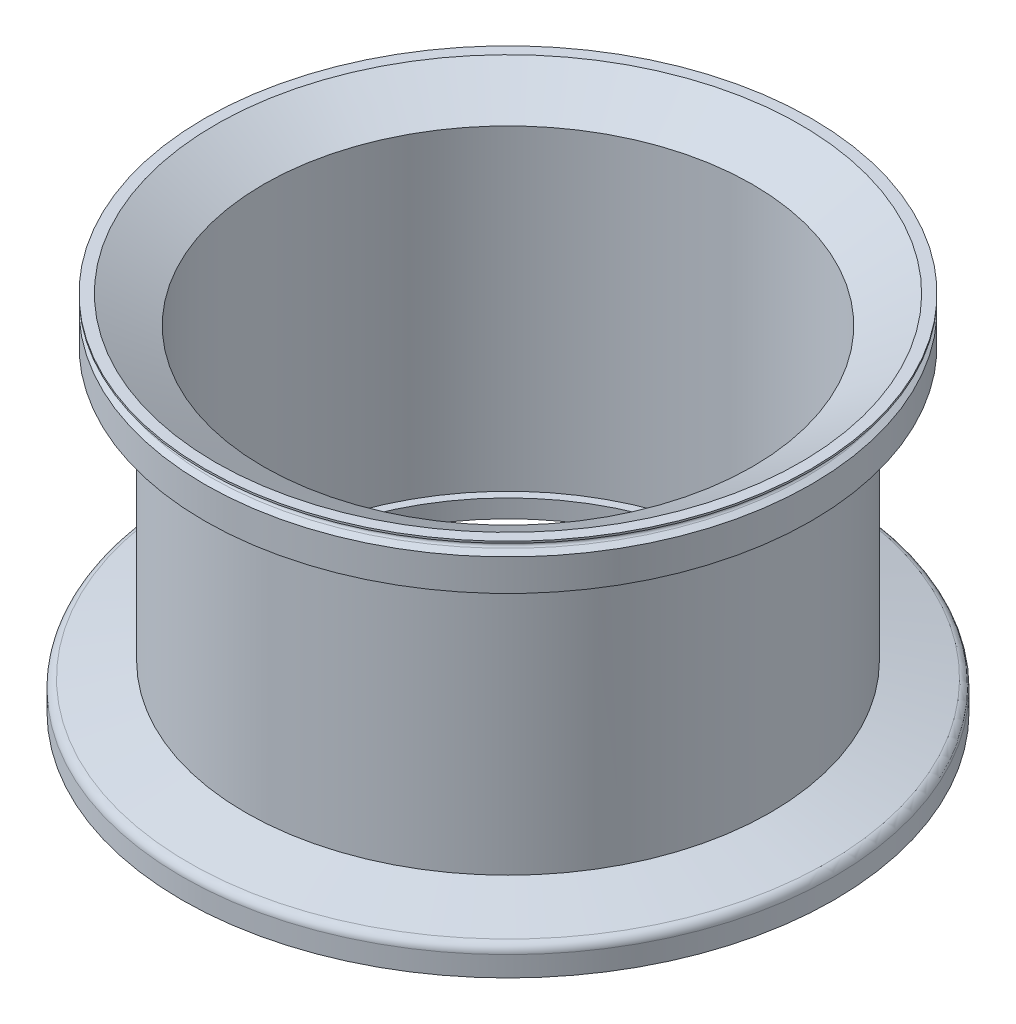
ISO-10303-21;
HEADER;
FILE_DESCRIPTION(('STEP AP214'),'2;1');
FILE_NAME('part.step','',(''),(''),'','','');
FILE_SCHEMA(('AUTOMOTIVE_DESIGN { 1 0 10303 214 1 1 1 1 }'));
ENDSEC;
DATA;
#1=APPLICATION_CONTEXT('core data for automotive mechanical design processes');
#2=APPLICATION_PROTOCOL_DEFINITION('international standard','automotive_design',2000,#1);
#3=PRODUCT_CONTEXT('',#1,'mechanical');
#4=PRODUCT('Part','Part','',(#3));
#5=PRODUCT_RELATED_PRODUCT_CATEGORY('part','',(#4));
#6=PRODUCT_DEFINITION_FORMATION('','',#4);
#7=PRODUCT_DEFINITION_CONTEXT('part definition',#1,'design');
#8=PRODUCT_DEFINITION('design','',#6,#7);
#9=PRODUCT_DEFINITION_SHAPE('','',#8);
#10=(LENGTH_UNIT() NAMED_UNIT(*) SI_UNIT(.MILLI.,.METRE.));
#11=(NAMED_UNIT(*) PLANE_ANGLE_UNIT() SI_UNIT($,.RADIAN.));
#12=(NAMED_UNIT(*) SI_UNIT($,.STERADIAN.) SOLID_ANGLE_UNIT());
#13=UNCERTAINTY_MEASURE_WITH_UNIT(LENGTH_MEASURE(1.E-05),#10,'distance_accuracy_value','');
#14=(GEOMETRIC_REPRESENTATION_CONTEXT(3) GLOBAL_UNCERTAINTY_ASSIGNED_CONTEXT((#13)) GLOBAL_UNIT_ASSIGNED_CONTEXT((#10,
#11,#12)) REPRESENTATION_CONTEXT('',''));
#15=CARTESIAN_POINT('',(0.,0.,0.));
#16=DIRECTION('',(0.,0.,1.));
#17=DIRECTION('',(1.,0.,0.));
#18=AXIS2_PLACEMENT_3D('',#15,#16,#17);
#19=CARTESIAN_POINT('',(0.,0.,0.));
#20=DIRECTION('',(0.,1.,0.));
#21=DIRECTION('',(0.,0.,1.));
#22=AXIS2_PLACEMENT_3D('',#19,#20,#21);
#23=CYLINDRICAL_SURFACE('',#22,33.5);
#24=CARTESIAN_POINT('',(0.,34.9999999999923,0.));
#25=DIRECTION('',(0.,1.,0.));
#26=DIRECTION('',(0.,0.,1.));
#27=AXIS2_PLACEMENT_3D('',#24,#25,#26);
#28=CIRCLE('',#27,33.5);
#29=CARTESIAN_POINT('',(0.,34.9999999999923,33.5));
#30=VERTEX_POINT('',#29);
#31=EDGE_CURVE('E18',#30,#30,#28,.F.);
#32=ORIENTED_EDGE('',*,*,#31,.F.);
#33=EDGE_LOOP('',(#32));
#34=FACE_BOUND('',#33,.T.);
#35=CARTESIAN_POINT('',(0.,38.4999999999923,0.));
#36=DIRECTION('',(0.,-1.,0.));
#37=DIRECTION('',(0.,0.,-1.));
#38=AXIS2_PLACEMENT_3D('',#35,#36,#37);
#39=CIRCLE('',#38,33.5);
#40=CARTESIAN_POINT('',(0.,38.4999999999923,-33.5));
#41=VERTEX_POINT('',#40);
#42=EDGE_CURVE('E31',#41,#41,#39,.F.);
#43=ORIENTED_EDGE('',*,*,#42,.F.);
#44=EDGE_LOOP('',(#43));
#45=FACE_BOUND('',#44,.T.);
#46=ADVANCED_FACE('F15',(#34,#45),#23,.T.);
#47=CARTESIAN_POINT('',(33.5,34.9999999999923,0.));
#48=DIRECTION('',(0.,-1.,0.));
#49=DIRECTION('',(0.,0.,-1.));
#50=AXIS2_PLACEMENT_3D('',#47,#48,#49);
#51=PLANE('',#50);
#52=ORIENTED_EDGE('',*,*,#31,.T.);
#53=EDGE_LOOP('',(#52));
#54=FACE_BOUND('',#53,.T.);
#55=CARTESIAN_POINT('',(0.,34.9999999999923,0.));
#56=DIRECTION('',(0.,1.,0.));
#57=DIRECTION('',(0.,0.,1.));
#58=AXIS2_PLACEMENT_3D('',#55,#56,#57);
#59=CIRCLE('',#58,29.);
#60=CARTESIAN_POINT('',(0.,34.9999999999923,29.));
#61=VERTEX_POINT('',#60);
#62=EDGE_CURVE('E47',#61,#61,#59,.F.);
#63=ORIENTED_EDGE('',*,*,#62,.F.);
#64=EDGE_LOOP('',(#63));
#65=FACE_BOUND('',#64,.T.);
#66=ADVANCED_FACE('F60',(#54,#65),#51,.T.);
#67=CARTESIAN_POINT('',(0.,38.4999999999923,0.));
#68=DIRECTION('',(0.,-1.,0.));
#69=DIRECTION('',(0.,0.,-1.));
#70=AXIS2_PLACEMENT_3D('',#67,#68,#69);
#71=CONICAL_SURFACE('',#70,33.5,1.04719755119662);
#72=CARTESIAN_POINT('',(0.,38.8678203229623,0.));
#73=DIRECTION('',(0.,1.,0.));
#74=DIRECTION('',(0.,0.,1.));
#75=AXIS2_PLACEMENT_3D('',#72,#73,#74);
#76=CIRCLE('',#75,32.8629165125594);
#77=CARTESIAN_POINT('',(0.,38.8678203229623,32.8629165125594));
#78=VERTEX_POINT('',#77);
#79=EDGE_CURVE('E49',#78,#78,#76,.F.);
#80=ORIENTED_EDGE('',*,*,#79,.T.);
#81=EDGE_LOOP('',(#80));
#82=FACE_BOUND('',#81,.T.);
#83=ORIENTED_EDGE('',*,*,#42,.T.);
#84=EDGE_LOOP('',(#83));
#85=FACE_BOUND('',#84,.T.);
#86=ADVANCED_FACE('F69',(#82,#85),#71,.T.);
#87=CARTESIAN_POINT('',(0.,0.,0.));
#88=DIRECTION('',(0.,1.,0.));
#89=DIRECTION('',(0.,0.,1.));
#90=AXIS2_PLACEMENT_3D('',#87,#88,#89);
#91=CYLINDRICAL_SURFACE('',#90,29.);
#92=CARTESIAN_POINT('',(0.,4.87564434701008,0.));
#93=DIRECTION('',(0.,-1.,0.));
#94=DIRECTION('',(0.,0.,-1.));
#95=AXIS2_PLACEMENT_3D('',#92,#93,#94);
#96=CIRCLE('',#95,29.);
#97=CARTESIAN_POINT('',(0.,4.87564434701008,-29.));
#98=VERTEX_POINT('',#97);
#99=EDGE_CURVE('E53',#98,#98,#96,.T.);
#100=ORIENTED_EDGE('',*,*,#99,.F.);
#101=EDGE_LOOP('',(#100));
#102=FACE_BOUND('',#101,.T.);
#103=ORIENTED_EDGE('',*,*,#62,.T.);
#104=EDGE_LOOP('',(#103));
#105=FACE_BOUND('',#104,.T.);
#106=ADVANCED_FACE('F137',(#102,#105),#91,.T.);
#107=CARTESIAN_POINT('',(0.,3.19859883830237,0.));
#108=DIRECTION('',(0.,-1.,0.));
#109=DIRECTION('',(0.,0.,-1.));
#110=AXIS2_PLACEMENT_3D('',#107,#108,#109);
#111=CONICAL_SURFACE('',#110,35.2588190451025,1.30899693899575);
#112=ORIENTED_EDGE('',*,*,#99,.T.);
#113=EDGE_LOOP('',(#112));
#114=FACE_BOUND('',#113,.T.);
#115=CARTESIAN_POINT('',(0.,3.19859883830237,0.));
#116=DIRECTION('',(0.,-1.,0.));
#117=DIRECTION('',(0.,0.,-1.));
#118=AXIS2_PLACEMENT_3D('',#115,#116,#117);
#119=CIRCLE('',#118,35.2588190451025);
#120=CARTESIAN_POINT('',(0.,3.19859883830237,-35.2588190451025));
#121=VERTEX_POINT('',#120);
#122=EDGE_CURVE('E126',#121,#121,#119,.T.);
#123=ORIENTED_EDGE('',*,*,#122,.F.);
#124=EDGE_LOOP('',(#123));
#125=FACE_BOUND('',#124,.T.);
#126=ADVANCED_FACE('F134',(#114,#125),#111,.T.);
#127=CARTESIAN_POINT('',(0.,39.1499999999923,0.));
#128=DIRECTION('',(0.,1.,0.));
#129=DIRECTION('',(0.,0.,1.));
#130=AXIS2_PLACEMENT_3D('',#127,#128,#129);
#131=TOROIDAL_SURFACE('',#130,33.0258330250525,0.325833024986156);
#132=ORIENTED_EDGE('',*,*,#79,.F.);
#133=EDGE_LOOP('',(#132));
#134=FACE_BOUND('',#133,.T.);
#135=CARTESIAN_POINT('',(0.,39.4321796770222,0.));
#136=DIRECTION('',(0.,1.,0.));
#137=DIRECTION('',(0.,0.,1.));
#138=AXIS2_PLACEMENT_3D('',#135,#136,#137);
#139=CIRCLE('',#138,32.8629165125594);
#140=CARTESIAN_POINT('',(0.,39.4321796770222,32.8629165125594));
#141=VERTEX_POINT('',#140);
#142=EDGE_CURVE('E124',#141,#141,#139,.T.);
#143=ORIENTED_EDGE('',*,*,#142,.F.);
#144=EDGE_LOOP('',(#143));
#145=FACE_BOUND('',#144,.T.);
#146=ADVANCED_FACE('F114',(#134,#145),#131,.F.);
#147=CARTESIAN_POINT('',(0.,2.2326730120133,0.));
#148=DIRECTION('',(0.,-1.,0.));
#149=DIRECTION('',(0.,0.,-1.));
#150=AXIS2_PLACEMENT_3D('',#147,#148,#149);
#151=TOROIDAL_SURFACE('',#150,35.,1.);
#152=ORIENTED_EDGE('',*,*,#122,.T.);
#153=EDGE_LOOP('',(#152));
#154=FACE_BOUND('',#153,.T.);
#155=CARTESIAN_POINT('',(0.,2.2326730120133,0.));
#156=DIRECTION('',(0.,1.,0.));
#157=DIRECTION('',(0.,0.,1.));
#158=AXIS2_PLACEMENT_3D('',#155,#156,#157);
#159=CIRCLE('',#158,36.);
#160=CARTESIAN_POINT('',(0.,2.2326730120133,36.));
#161=VERTEX_POINT('',#160);
#162=EDGE_CURVE('E121',#161,#161,#159,.F.);
#163=ORIENTED_EDGE('',*,*,#162,.F.);
#164=EDGE_LOOP('',(#163));
#165=FACE_BOUND('',#164,.T.);
#166=ADVANCED_FACE('F109',(#154,#165),#151,.T.);
#167=CARTESIAN_POINT('',(0.,39.7999999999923,0.));
#168=DIRECTION('',(0.,1.,0.));
#169=DIRECTION('',(0.,0.,1.));
#170=AXIS2_PLACEMENT_3D('',#167,#168,#169);
#171=CONICAL_SURFACE('',#170,33.5,1.04719755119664);
#172=ORIENTED_EDGE('',*,*,#142,.T.);
#173=EDGE_LOOP('',(#172));
#174=FACE_BOUND('',#173,.T.);
#175=CARTESIAN_POINT('',(0.,39.7999999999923,0.));
#176=DIRECTION('',(0.,1.,0.));
#177=DIRECTION('',(0.,0.,1.));
#178=AXIS2_PLACEMENT_3D('',#175,#176,#177);
#179=CIRCLE('',#178,33.5);
#180=CARTESIAN_POINT('',(0.,39.7999999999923,33.5));
#181=VERTEX_POINT('',#180);
#182=EDGE_CURVE('E46',#181,#181,#179,.T.);
#183=ORIENTED_EDGE('',*,*,#182,.F.);
#184=EDGE_LOOP('',(#183));
#185=FACE_BOUND('',#184,.T.);
#186=ADVANCED_FACE('F105',(#174,#185),#171,.T.);
#187=CARTESIAN_POINT('',(0.,0.,0.));
#188=DIRECTION('',(0.,1.,0.));
#189=DIRECTION('',(0.,0.,1.));
#190=AXIS2_PLACEMENT_3D('',#187,#188,#189);
#191=CYLINDRICAL_SURFACE('',#190,36.);
#192=CARTESIAN_POINT('',(0.,-7.73306743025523E-12,0.));
#193=DIRECTION('',(0.,1.,0.));
#194=DIRECTION('',(0.,0.,1.));
#195=AXIS2_PLACEMENT_3D('',#192,#193,#194);
#196=CIRCLE('',#195,36.);
#197=CARTESIAN_POINT('',(0.,-7.73306743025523E-12,36.));
#198=VERTEX_POINT('',#197);
#199=EDGE_CURVE('E44',#198,#198,#196,.F.);
#200=ORIENTED_EDGE('',*,*,#199,.F.);
#201=EDGE_LOOP('',(#200));
#202=FACE_BOUND('',#201,.T.);
#203=ORIENTED_EDGE('',*,*,#162,.T.);
#204=EDGE_LOOP('',(#203));
#205=FACE_BOUND('',#204,.T.);
#206=ADVANCED_FACE('F101',(#202,#205),#191,.T.);
#207=CARTESIAN_POINT('',(0.,0.,0.));
#208=DIRECTION('',(0.,1.,0.));
#209=DIRECTION('',(0.,0.,1.));
#210=AXIS2_PLACEMENT_3D('',#207,#208,#209);
#211=CYLINDRICAL_SURFACE('',#210,33.5);
#212=ORIENTED_EDGE('',*,*,#182,.T.);
#213=EDGE_LOOP('',(#212));
#214=FACE_BOUND('',#213,.T.);
#215=CARTESIAN_POINT('',(0.,39.9999999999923,0.));
#216=DIRECTION('',(0.,1.,0.));
#217=DIRECTION('',(0.,0.,1.));
#218=AXIS2_PLACEMENT_3D('',#215,#216,#217);
#219=CIRCLE('',#218,33.5);
#220=CARTESIAN_POINT('',(0.,39.9999999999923,33.5));
#221=VERTEX_POINT('',#220);
#222=EDGE_CURVE('E41',#221,#221,#219,.T.);
#223=ORIENTED_EDGE('',*,*,#222,.F.);
#224=EDGE_LOOP('',(#223));
#225=FACE_BOUND('',#224,.T.);
#226=ADVANCED_FACE('F97',(#214,#225),#211,.T.);
#227=CARTESIAN_POINT('',(36.,-7.73306743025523E-12,0.));
#228=DIRECTION('',(0.,-1.,0.));
#229=DIRECTION('',(0.,0.,-1.));
#230=AXIS2_PLACEMENT_3D('',#227,#228,#229);
#231=PLANE('',#230);
#232=ORIENTED_EDGE('',*,*,#199,.T.);
#233=EDGE_LOOP('',(#232));
#234=FACE_BOUND('',#233,.T.);
#235=CARTESIAN_POINT('',(0.,-7.73306743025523E-12,0.));
#236=DIRECTION('',(0.,1.,0.));
#237=DIRECTION('',(0.,0.,1.));
#238=AXIS2_PLACEMENT_3D('',#235,#236,#237);
#239=CIRCLE('',#238,26.1);
#240=CARTESIAN_POINT('',(0.,-7.73306743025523E-12,26.1));
#241=VERTEX_POINT('',#240);
#242=EDGE_CURVE('E38',#241,#241,#239,.T.);
#243=ORIENTED_EDGE('',*,*,#242,.T.);
#244=EDGE_LOOP('',(#243));
#245=FACE_BOUND('',#244,.T.);
#246=ADVANCED_FACE('F93',(#234,#245),#231,.T.);
#247=CARTESIAN_POINT('',(32.2999999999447,39.9999999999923,0.));
#248=DIRECTION('',(0.,1.,0.));
#249=DIRECTION('',(0.,0.,1.));
#250=AXIS2_PLACEMENT_3D('',#247,#248,#249);
#251=PLANE('',#250);
#252=CARTESIAN_POINT('',(0.,39.9999999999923,0.));
#253=DIRECTION('',(0.,1.,0.));
#254=DIRECTION('',(0.,0.,1.));
#255=AXIS2_PLACEMENT_3D('',#252,#253,#254);
#256=CIRCLE('',#255,32.2999999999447);
#257=CARTESIAN_POINT('',(0.,39.9999999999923,32.2999999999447));
#258=VERTEX_POINT('',#257);
#259=EDGE_CURVE('E35',#258,#258,#256,.F.);
#260=ORIENTED_EDGE('',*,*,#259,.T.);
#261=EDGE_LOOP('',(#260));
#262=FACE_BOUND('',#261,.T.);
#263=ORIENTED_EDGE('',*,*,#222,.T.);
#264=EDGE_LOOP('',(#263));
#265=FACE_BOUND('',#264,.T.);
#266=ADVANCED_FACE('F89',(#262,#265),#251,.T.);
#267=CARTESIAN_POINT('',(0.,0.,0.));
#268=DIRECTION('',(0.,1.,0.));
#269=DIRECTION('',(0.,0.,1.));
#270=AXIS2_PLACEMENT_3D('',#267,#268,#269);
#271=CYLINDRICAL_SURFACE('',#270,26.1);
#272=CARTESIAN_POINT('',(0.,1.99999999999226,0.));
#273=DIRECTION('',(0.,1.,0.));
#274=DIRECTION('',(0.,0.,1.));
#275=AXIS2_PLACEMENT_3D('',#272,#273,#274);
#276=CIRCLE('',#275,26.1);
#277=CARTESIAN_POINT('',(0.,1.99999999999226,26.1));
#278=VERTEX_POINT('',#277);
#279=EDGE_CURVE('E27',#278,#278,#276,.F.);
#280=ORIENTED_EDGE('',*,*,#279,.F.);
#281=EDGE_LOOP('',(#280));
#282=FACE_BOUND('',#281,.T.);
#283=ORIENTED_EDGE('',*,*,#242,.F.);
#284=EDGE_LOOP('',(#283));
#285=FACE_BOUND('',#284,.T.);
#286=ADVANCED_FACE('F85',(#282,#285),#271,.F.);
#287=CARTESIAN_POINT('',(0.,39.9999999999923,0.));
#288=DIRECTION('',(0.,1.,0.));
#289=DIRECTION('',(0.,0.,1.));
#290=AXIS2_PLACEMENT_3D('',#287,#288,#289);
#291=CONICAL_SURFACE('',#290,32.2999999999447,1.0471975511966);
#292=ORIENTED_EDGE('',*,*,#259,.F.);
#293=EDGE_LOOP('',(#292));
#294=FACE_BOUND('',#293,.T.);
#295=CARTESIAN_POINT('',(0.,36.9400435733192,0.));
#296=DIRECTION('',(0.,1.,0.));
#297=DIRECTION('',(0.,0.,1.));
#298=AXIS2_PLACEMENT_3D('',#295,#296,#297);
#299=CIRCLE('',#298,27.);
#300=CARTESIAN_POINT('',(0.,36.9400435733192,27.));
#301=VERTEX_POINT('',#300);
#302=EDGE_CURVE('E22',#301,#301,#299,.F.);
#303=ORIENTED_EDGE('',*,*,#302,.T.);
#304=EDGE_LOOP('',(#303));
#305=FACE_BOUND('',#304,.T.);
#306=ADVANCED_FACE('F78',(#294,#305),#291,.F.);
#307=CARTESIAN_POINT('',(0.,1.99999999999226,0.));
#308=DIRECTION('',(0.,1.,0.));
#309=DIRECTION('',(0.,0.,1.));
#310=AXIS2_PLACEMENT_3D('',#307,#308,#309);
#311=PLANE('',#310);
#312=CARTESIAN_POINT('',(0.,1.99999999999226,0.));
#313=DIRECTION('',(0.,1.,0.));
#314=DIRECTION('',(0.,0.,1.));
#315=AXIS2_PLACEMENT_3D('',#312,#313,#314);
#316=CIRCLE('',#315,27.);
#317=CARTESIAN_POINT('',(0.,1.99999999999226,27.));
#318=VERTEX_POINT('',#317);
#319=EDGE_CURVE('E10',#318,#318,#316,.T.);
#320=ORIENTED_EDGE('',*,*,#319,.T.);
#321=EDGE_LOOP('',(#320));
#322=FACE_BOUND('',#321,.T.);
#323=ORIENTED_EDGE('',*,*,#279,.T.);
#324=EDGE_LOOP('',(#323));
#325=FACE_BOUND('',#324,.T.);
#326=ADVANCED_FACE('F72',(#322,#325),#311,.T.);
#327=CARTESIAN_POINT('',(0.,1.99999999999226,0.));
#328=DIRECTION('',(0.,1.,0.));
#329=DIRECTION('',(0.,0.,1.));
#330=AXIS2_PLACEMENT_3D('',#327,#328,#329);
#331=CYLINDRICAL_SURFACE('',#330,27.);
#332=ORIENTED_EDGE('',*,*,#302,.F.);
#333=EDGE_LOOP('',(#332));
#334=FACE_BOUND('',#333,.T.);
#335=ORIENTED_EDGE('',*,*,#319,.F.);
#336=EDGE_LOOP('',(#335));
#337=FACE_BOUND('',#336,.T.);
#338=ADVANCED_FACE('F70',(#334,#337),#331,.F.);
#339=CLOSED_SHELL('',(#46,#66,#86,#106,#126,#146,#166,#186,#206,#226,#246,#266,#286,#306,#326,#338));
#340=MANIFOLD_SOLID_BREP('B1',#339);
#341=ADVANCED_BREP_SHAPE_REPRESENTATION('',(#18,#340),#14);
#342=SHAPE_DEFINITION_REPRESENTATION(#9,#341);
ENDSEC;
END-ISO-10303-21;
